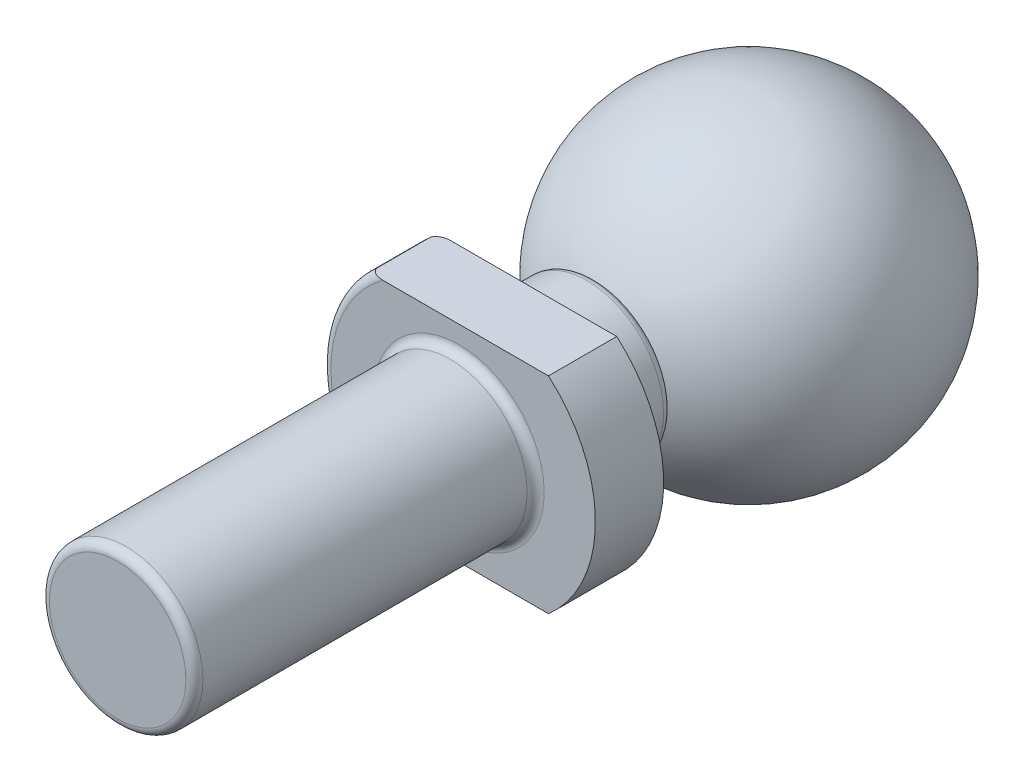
ISO-10303-21;
HEADER;
FILE_DESCRIPTION(('STEP AP214'),'2;1');
FILE_NAME('part.step','',(''),(''),'','','');
FILE_SCHEMA(('AUTOMOTIVE_DESIGN { 1 0 10303 214 1 1 1 1 }'));
ENDSEC;
DATA;
#1=APPLICATION_CONTEXT('core data for automotive mechanical design processes');
#2=APPLICATION_PROTOCOL_DEFINITION('international standard','automotive_design',2000,#1);
#3=PRODUCT_CONTEXT('',#1,'mechanical');
#4=PRODUCT('Part','Part','',(#3));
#5=PRODUCT_RELATED_PRODUCT_CATEGORY('part','',(#4));
#6=PRODUCT_DEFINITION_FORMATION('','',#4);
#7=PRODUCT_DEFINITION_CONTEXT('part definition',#1,'design');
#8=PRODUCT_DEFINITION('design','',#6,#7);
#9=PRODUCT_DEFINITION_SHAPE('','',#8);
#10=(LENGTH_UNIT() NAMED_UNIT(*) SI_UNIT(.MILLI.,.METRE.));
#11=(NAMED_UNIT(*) PLANE_ANGLE_UNIT() SI_UNIT($,.RADIAN.));
#12=(NAMED_UNIT(*) SI_UNIT($,.STERADIAN.) SOLID_ANGLE_UNIT());
#13=UNCERTAINTY_MEASURE_WITH_UNIT(LENGTH_MEASURE(1.E-05),#10,'distance_accuracy_value','');
#14=(GEOMETRIC_REPRESENTATION_CONTEXT(3) GLOBAL_UNCERTAINTY_ASSIGNED_CONTEXT((#13)) GLOBAL_UNIT_ASSIGNED_CONTEXT((#10,
#11,#12)) REPRESENTATION_CONTEXT('',''));
#15=CARTESIAN_POINT('',(0.,0.,0.));
#16=DIRECTION('',(0.,0.,1.));
#17=DIRECTION('',(1.,0.,0.));
#18=AXIS2_PLACEMENT_3D('',#15,#16,#17);
#19=CARTESIAN_POINT('',(0.,4.75,8.5));
#20=DIRECTION('',(0.,0.,-1.));
#21=DIRECTION('',(-1.,0.,0.));
#22=AXIS2_PLACEMENT_3D('',#19,#20,#21);
#23=CYLINDRICAL_SURFACE('',#22,4.);
#24=CARTESIAN_POINT('',(0.,4.75,8.5));
#25=DIRECTION('',(0.,0.,1.));
#26=DIRECTION('',(1.,0.,0.));
#27=AXIS2_PLACEMENT_3D('',#24,#25,#26);
#28=CIRCLE('',#27,4.);
#29=CARTESIAN_POINT('',(2.625,1.73182588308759,8.5));
#30=VERTEX_POINT('',#29);
#31=CARTESIAN_POINT('',(2.625,7.76817411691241,8.5));
#32=VERTEX_POINT('',#31);
#33=EDGE_CURVE('E99',#30,#32,#28,.T.);
#34=ORIENTED_EDGE('',*,*,#33,.F.);
#35=DIRECTION('',(0.,0.,1.));
#36=VECTOR('',#35,1.);
#37=CARTESIAN_POINT('',(2.625,1.73182588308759,-4.751));
#38=LINE('',#37,#36);
#39=CARTESIAN_POINT('',(2.625,1.73182588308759,6.5));
#40=VERTEX_POINT('',#39);
#41=EDGE_CURVE('E85',#40,#30,#38,.T.);
#42=ORIENTED_EDGE('',*,*,#41,.F.);
#43=CARTESIAN_POINT('',(0.,4.75,6.5));
#44=DIRECTION('',(0.,0.,1.));
#45=DIRECTION('',(1.,0.,0.));
#46=AXIS2_PLACEMENT_3D('',#43,#44,#45);
#47=CIRCLE('',#46,4.);
#48=CARTESIAN_POINT('',(2.625,7.76817411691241,6.5));
#49=VERTEX_POINT('',#48);
#50=EDGE_CURVE('E96',#40,#49,#47,.T.);
#51=ORIENTED_EDGE('',*,*,#50,.T.);
#52=DIRECTION('',(0.,0.,1.));
#53=VECTOR('',#52,1.);
#54=CARTESIAN_POINT('',(2.625,7.76817411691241,-4.751));
#55=LINE('',#54,#53);
#56=EDGE_CURVE('E107',#49,#32,#55,.T.);
#57=ORIENTED_EDGE('',*,*,#56,.T.);
#58=EDGE_LOOP('',(#34,#42,#51,#57));
#59=FACE_BOUND('',#58,.T.);
#60=ADVANCED_FACE('F26',(#59),#23,.T.);
#61=CARTESIAN_POINT('',(0.,4.75,8.5));
#62=DIRECTION('',(0.,0.,1.));
#63=DIRECTION('',(1.,0.,0.));
#64=AXIS2_PLACEMENT_3D('',#61,#62,#63);
#65=PLANE('',#64);
#66=CARTESIAN_POINT('',(0.,4.75,8.5));
#67=DIRECTION('',(0.,0.,1.));
#68=DIRECTION('',(1.,0.,0.));
#69=AXIS2_PLACEMENT_3D('',#66,#67,#68);
#70=CIRCLE('',#69,2.5);
#71=CARTESIAN_POINT('',(2.5,4.75,8.5));
#72=VERTEX_POINT('',#71);
#73=EDGE_CURVE('E131',#72,#72,#70,.F.);
#74=ORIENTED_EDGE('',*,*,#73,.T.);
#75=EDGE_LOOP('',(#74));
#76=FACE_BOUND('',#75,.T.);
#77=DIRECTION('',(1.,0.,0.));
#78=VECTOR('',#77,1.);
#79=CARTESIAN_POINT('',(-2.625,7.76817411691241,8.5));
#80=LINE('',#79,#78);
#81=CARTESIAN_POINT('',(-2.22556172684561,7.76817411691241,8.5));
#82=VERTEX_POINT('',#81);
#83=EDGE_CURVE('E90',#82,#32,#80,.T.);
#84=ORIENTED_EDGE('',*,*,#83,.F.);
#85=CARTESIAN_POINT('',(0.,4.75,8.5));
#86=DIRECTION('',(0.,0.,1.));
#87=DIRECTION('',(1.,0.,0.));
#88=AXIS2_PLACEMENT_3D('',#85,#86,#87);
#89=CIRCLE('',#88,3.75);
#90=CARTESIAN_POINT('',(-2.2255617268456,1.73182588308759,8.5));
#91=VERTEX_POINT('',#90);
#92=EDGE_CURVE('E128',#82,#91,#89,.T.);
#93=ORIENTED_EDGE('',*,*,#92,.T.);
#94=DIRECTION('',(-1.,0.,0.));
#95=VECTOR('',#94,1.);
#96=CARTESIAN_POINT('',(2.625,1.73182588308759,8.5));
#97=LINE('',#96,#95);
#98=EDGE_CURVE('E100',#30,#91,#97,.T.);
#99=ORIENTED_EDGE('',*,*,#98,.F.);
#100=ORIENTED_EDGE('',*,*,#33,.T.);
#101=EDGE_LOOP('',(#84,#93,#99,#100));
#102=FACE_BOUND('',#101,.T.);
#103=ADVANCED_FACE('F196',(#76,#102),#65,.T.);
#104=CARTESIAN_POINT('',(0.,4.75,3.));
#105=DIRECTION('',(0.,0.,1.));
#106=DIRECTION('',(1.,0.,0.));
#107=AXIS2_PLACEMENT_3D('',#104,#105,#106);
#108=PLANE('',#107);
#109=CARTESIAN_POINT('',(0.,4.75,3.));
#110=DIRECTION('',(0.,0.,1.));
#111=DIRECTION('',(1.,0.,0.));
#112=AXIS2_PLACEMENT_3D('',#109,#110,#111);
#113=CIRCLE('',#112,1.75);
#114=CARTESIAN_POINT('',(-1.75,4.75,3.));
#115=VERTEX_POINT('',#114);
#116=EDGE_CURVE('E116',#115,#115,#113,.T.);
#117=ORIENTED_EDGE('',*,*,#116,.T.);
#118=EDGE_LOOP('',(#117));
#119=FACE_BOUND('',#118,.T.);
#120=CARTESIAN_POINT('',(0.,4.75,3.));
#121=DIRECTION('',(0.,0.,1.));
#122=DIRECTION('',(1.,0.,0.));
#123=AXIS2_PLACEMENT_3D('',#120,#121,#122);
#124=CIRCLE('',#123,1.5);
#125=CARTESIAN_POINT('',(1.5,4.75,3.));
#126=VERTEX_POINT('',#125);
#127=EDGE_CURVE('E105',#126,#126,#124,.T.);
#128=ORIENTED_EDGE('',*,*,#127,.F.);
#129=EDGE_LOOP('',(#128));
#130=FACE_BOUND('',#129,.T.);
#131=ADVANCED_FACE('F203',(#119,#130),#108,.T.);
#132=CARTESIAN_POINT('',(0.,4.75,0.));
#133=DIRECTION('',(0.,-1.,0.));
#134=DIRECTION('',(-1.,0.,0.));
#135=AXIS2_PLACEMENT_3D('',#132,#133,#134);
#136=SPHERICAL_SURFACE('',#135,4.75);
#137=CARTESIAN_POINT('',(0.,4.75,0.));
#138=DIRECTION('',(0.,0.,-1.));
#139=DIRECTION('',(-1.,0.,0.));
#140=AXIS2_PLACEMENT_3D('',#137,#138,#139);
#141=SPHERICAL_SURFACE('',#140,4.75);
#142=CARTESIAN_POINT('',(0.,4.75,4.41588043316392));
#143=DIRECTION('',(0.,0.,-1.));
#144=DIRECTION('',(-1.,0.,0.));
#145=AXIS2_PLACEMENT_3D('',#142,#143,#144);
#146=CIRCLE('',#145,1.75);
#147=CARTESIAN_POINT('',(-1.75,4.75,4.41588043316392));
#148=VERTEX_POINT('',#147);
#149=EDGE_CURVE('E119',#148,#148,#146,.T.);
#150=ORIENTED_EDGE('',*,*,#149,.T.);
#151=EDGE_LOOP('',(#150));
#152=FACE_BOUND('',#151,.T.);
#153=ADVANCED_FACE('F28',(#152),#141,.T.);
#154=CARTESIAN_POINT('',(0.,4.75,4.75));
#155=DIRECTION('',(0.,0.,-1.));
#156=DIRECTION('',(-1.,0.,0.));
#157=AXIS2_PLACEMENT_3D('',#154,#155,#156);
#158=CYLINDRICAL_SURFACE('',#157,1.75);
#159=CARTESIAN_POINT('',(-1.75,4.75,4.41588043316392));
#160=CARTESIAN_POINT('',(-1.75,4.75,4.4011316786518));
#161=CARTESIAN_POINT('',(-1.75,4.75,4.38638292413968));
#162=CARTESIAN_POINT('',(-1.75,4.75,4.35688541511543));
#163=CARTESIAN_POINT('',(-1.75,4.75,4.3421366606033));
#164=CARTESIAN_POINT('',(-1.75,4.75,4.31263915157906));
#165=CARTESIAN_POINT('',(-1.75,4.75,4.29789039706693));
#166=CARTESIAN_POINT('',(-1.75,4.75,4.26839288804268));
#167=CARTESIAN_POINT('',(-1.75,4.75,4.25364413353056));
#168=CARTESIAN_POINT('',(-1.75,4.75,4.22414662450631));
#169=CARTESIAN_POINT('',(-1.75,4.75,4.20939786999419));
#170=CARTESIAN_POINT('',(-1.75,4.75,4.17990036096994));
#171=CARTESIAN_POINT('',(-1.75,4.75,4.16515160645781));
#172=CARTESIAN_POINT('',(-1.75,4.75,4.13565409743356));
#173=CARTESIAN_POINT('',(-1.75,4.75,4.12090534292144));
#174=CARTESIAN_POINT('',(-1.75,4.75,4.09140783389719));
#175=CARTESIAN_POINT('',(-1.75,4.75,4.07665907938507));
#176=CARTESIAN_POINT('',(-1.75,4.75,4.04716157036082));
#177=CARTESIAN_POINT('',(-1.75,4.75,4.0324128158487));
#178=CARTESIAN_POINT('',(-1.75,4.75,4.00291530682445));
#179=CARTESIAN_POINT('',(-1.75,4.75,3.98816655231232));
#180=CARTESIAN_POINT('',(-1.75,4.75,3.95866904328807));
#181=CARTESIAN_POINT('',(-1.75,4.75,3.94392028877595));
#182=CARTESIAN_POINT('',(-1.75,4.75,3.9144227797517));
#183=CARTESIAN_POINT('',(-1.75,4.75,3.89967402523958));
#184=CARTESIAN_POINT('',(-1.75,4.75,3.87017651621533));
#185=CARTESIAN_POINT('',(-1.75,4.75,3.8554277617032));
#186=CARTESIAN_POINT('',(-1.75,4.75,3.82593025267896));
#187=CARTESIAN_POINT('',(-1.75,4.75,3.81118149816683));
#188=CARTESIAN_POINT('',(-1.75,4.75,3.78168398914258));
#189=CARTESIAN_POINT('',(-1.75,4.75,3.76693523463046));
#190=CARTESIAN_POINT('',(-1.75,4.75,3.73743772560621));
#191=CARTESIAN_POINT('',(-1.75,4.75,3.72268897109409));
#192=CARTESIAN_POINT('',(-1.75,4.75,3.69319146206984));
#193=CARTESIAN_POINT('',(-1.75,4.75,3.67844270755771));
#194=CARTESIAN_POINT('',(-1.75,4.75,3.64894519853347));
#195=CARTESIAN_POINT('',(-1.75,4.75,3.63419644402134));
#196=CARTESIAN_POINT('',(-1.75,4.75,3.60469893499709));
#197=CARTESIAN_POINT('',(-1.75,4.75,3.58995018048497));
#198=CARTESIAN_POINT('',(-1.75,4.75,3.56045267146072));
#199=CARTESIAN_POINT('',(-1.75,4.75,3.5457039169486));
#200=CARTESIAN_POINT('',(-1.75,4.75,3.51620640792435));
#201=CARTESIAN_POINT('',(-1.75,4.75,3.50145765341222));
#202=CARTESIAN_POINT('',(-1.75,4.75,3.47196014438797));
#203=CARTESIAN_POINT('',(-1.75,4.75,3.45721138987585));
#204=CARTESIAN_POINT('',(-1.75,4.75,3.4277138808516));
#205=CARTESIAN_POINT('',(-1.75,4.75,3.41296512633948));
#206=CARTESIAN_POINT('',(-1.75,4.75,3.38346761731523));
#207=CARTESIAN_POINT('',(-1.75,4.75,3.36871886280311));
#208=CARTESIAN_POINT('',(-1.75,4.75,3.33922135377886));
#209=CARTESIAN_POINT('',(-1.75,4.75,3.32447259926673));
#210=CARTESIAN_POINT('',(-1.75,4.75,3.29497509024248));
#211=CARTESIAN_POINT('',(-1.75,4.75,3.28022633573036));
#212=CARTESIAN_POINT('',(-1.75,4.75,3.25072882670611));
#213=CARTESIAN_POINT('',(-1.75,4.75,3.23598007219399));
#214=CARTESIAN_POINT('',(-1.75,4.75,3.20648256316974));
#215=CARTESIAN_POINT('',(-1.75,4.75,3.19173380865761));
#216=CARTESIAN_POINT('',(-1.75,4.75,3.16223629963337));
#217=CARTESIAN_POINT('',(-1.75,4.75,3.14748754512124));
#218=CARTESIAN_POINT('',(-1.75,4.75,3.11799003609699));
#219=CARTESIAN_POINT('',(-1.75,4.75,3.10324128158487));
#220=CARTESIAN_POINT('',(-1.75,4.75,3.07374377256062));
#221=CARTESIAN_POINT('',(-1.75,4.75,3.0589950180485));
#222=CARTESIAN_POINT('',(-1.75,4.75,3.02949750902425));
#223=CARTESIAN_POINT('',(-1.75,4.75,3.01474875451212));
#224=CARTESIAN_POINT('',(-1.75,4.75,3.));
#225=B_SPLINE_CURVE_WITH_KNOTS('',3,(#159,#160,#161,#162,#163,#164,#165,#166,#167,#168,#169,
#170,#171,#172,#173,#174,#175,#176,#177,#178,#179,#180,#181,#182,#183,#184,#185,#186,#187,#188,
#189,#190,#191,#192,#193,#194,#195,#196,#197,#198,#199,#200,#201,#202,#203,#204,#205,#206,#207,
#208,#209,#210,#211,#212,#213,#214,#215,#216,#217,#218,#219,#220,#221,#222,#223,#224),
.UNSPECIFIED.,.F.,.F.,(4,2,2,2,2,2,2,2,2,2,2,2,2,2,2,2,2,2,2,2,2,2,2,2,2,2,2,2,2,2,2,2,4),(0.,
0.0442462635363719,0.0884925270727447,0.132738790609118,0.17698505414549,0.221231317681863,
0.265477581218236,0.309723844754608,0.353970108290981,0.398216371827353,0.442462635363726,
0.486708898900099,0.530955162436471,0.575201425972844,0.619447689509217,0.663693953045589,
0.707940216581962,0.752186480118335,0.796432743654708,0.84067900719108,0.884925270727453,
0.929171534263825,0.973417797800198,1.01766406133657,1.06191032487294,1.10615658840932,
1.15040285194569,1.19464911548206,1.23889537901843,1.28314164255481,1.32738790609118,
1.37163416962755,1.41588043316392),.UNSPECIFIED.);
#226=EDGE_CURVE('BSEAM313',#148,#115,#225,.T.);
#227=ORIENTED_EDGE('',*,*,#149,.F.);
#228=ORIENTED_EDGE('',*,*,#116,.F.);
#229=ORIENTED_EDGE('',*,*,#226,.T.);
#230=ORIENTED_EDGE('',*,*,#226,.F.);
#231=EDGE_LOOP('',(#227,#229,#228,#230));
#232=FACE_BOUND('',#231,.T.);
#233=ADVANCED_FACE('F313',(#232),#158,.F.);
#234=CARTESIAN_POINT('',(0.,4.75,4.5));
#235=DIRECTION('',(0.,0.,-1.));
#236=DIRECTION('',(-1.,0.,0.));
#237=AXIS2_PLACEMENT_3D('',#234,#235,#236);
#238=CYLINDRICAL_SURFACE('',#237,1.5);
#239=CARTESIAN_POINT('',(0.,4.75,4.5));
#240=DIRECTION('',(0.,0.,1.));
#241=DIRECTION('',(1.,0.,0.));
#242=AXIS2_PLACEMENT_3D('',#239,#240,#241);
#243=CIRCLE('',#242,1.5);
#244=CARTESIAN_POINT('',(1.5,4.75,4.5));
#245=VERTEX_POINT('',#244);
#246=EDGE_CURVE('E113',#245,#245,#243,.T.);
#247=ORIENTED_EDGE('',*,*,#246,.F.);
#248=EDGE_LOOP('',(#247));
#249=FACE_BOUND('',#248,.T.);
#250=ORIENTED_EDGE('',*,*,#127,.T.);
#251=EDGE_LOOP('',(#250));
#252=FACE_BOUND('',#251,.T.);
#253=ADVANCED_FACE('F307',(#249,#252),#238,.T.);
#254=CARTESIAN_POINT('',(0.,4.75,4.5));
#255=DIRECTION('',(0.,0.,1.));
#256=DIRECTION('',(1.,0.,0.));
#257=AXIS2_PLACEMENT_3D('',#254,#255,#256);
#258=PLANE('',#257);
#259=CARTESIAN_POINT('',(0.,4.75,4.5));
#260=DIRECTION('',(0.,0.,1.));
#261=DIRECTION('',(1.,0.,0.));
#262=AXIS2_PLACEMENT_3D('',#259,#260,#261);
#263=CIRCLE('',#262,2.);
#264=CARTESIAN_POINT('',(2.,4.75,4.5));
#265=VERTEX_POINT('',#264);
#266=EDGE_CURVE('E11',#265,#265,#263,.F.);
#267=ORIENTED_EDGE('',*,*,#266,.T.);
#268=EDGE_LOOP('',(#267));
#269=FACE_BOUND('',#268,.T.);
#270=ORIENTED_EDGE('',*,*,#246,.T.);
#271=EDGE_LOOP('',(#270));
#272=FACE_BOUND('',#271,.T.);
#273=ADVANCED_FACE('F301',(#269,#272),#258,.F.);
#274=CARTESIAN_POINT('',(0.,4.75,6.5));
#275=DIRECTION('',(0.,0.,-1.));
#276=DIRECTION('',(-1.,0.,0.));
#277=AXIS2_PLACEMENT_3D('',#274,#275,#276);
#278=CYLINDRICAL_SURFACE('',#277,2.25);
#279=CARTESIAN_POINT('',(0.,4.75,6.25));
#280=DIRECTION('',(0.,0.,1.));
#281=DIRECTION('',(1.,0.,0.));
#282=AXIS2_PLACEMENT_3D('',#279,#280,#281);
#283=CIRCLE('',#282,2.25);
#284=CARTESIAN_POINT('',(2.25,4.75,6.25));
#285=VERTEX_POINT('',#284);
#286=EDGE_CURVE('E34',#285,#285,#283,.F.);
#287=ORIENTED_EDGE('',*,*,#286,.T.);
#288=EDGE_LOOP('',(#287));
#289=FACE_BOUND('',#288,.T.);
#290=CARTESIAN_POINT('',(0.,4.75,4.75));
#291=DIRECTION('',(0.,0.,1.));
#292=DIRECTION('',(1.,0.,0.));
#293=AXIS2_PLACEMENT_3D('',#290,#291,#292);
#294=CIRCLE('',#293,2.25);
#295=CARTESIAN_POINT('',(2.25,4.75,4.75));
#296=VERTEX_POINT('',#295);
#297=EDGE_CURVE('E231',#296,#296,#294,.T.);
#298=ORIENTED_EDGE('',*,*,#297,.T.);
#299=EDGE_LOOP('',(#298));
#300=FACE_BOUND('',#299,.T.);
#301=ADVANCED_FACE('F214',(#289,#300),#278,.T.);
#302=CARTESIAN_POINT('',(0.,4.75,6.5));
#303=DIRECTION('',(0.,0.,1.));
#304=DIRECTION('',(1.,0.,0.));
#305=AXIS2_PLACEMENT_3D('',#302,#303,#304);
#306=PLANE('',#305);
#307=CARTESIAN_POINT('',(0.,4.75,6.5));
#308=DIRECTION('',(0.,0.,1.));
#309=DIRECTION('',(1.,0.,0.));
#310=AXIS2_PLACEMENT_3D('',#307,#308,#309);
#311=CIRCLE('',#310,2.5);
#312=CARTESIAN_POINT('',(2.5,4.75,6.5));
#313=VERTEX_POINT('',#312);
#314=EDGE_CURVE('E179',#313,#313,#311,.T.);
#315=ORIENTED_EDGE('',*,*,#314,.T.);
#316=EDGE_LOOP('',(#315));
#317=FACE_BOUND('',#316,.T.);
#318=DIRECTION('',(1.,0.,0.));
#319=VECTOR('',#318,1.);
#320=CARTESIAN_POINT('',(2.625,1.73182588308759,6.5));
#321=LINE('',#320,#319);
#322=CARTESIAN_POINT('',(-2.22556172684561,1.73182588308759,6.5));
#323=VERTEX_POINT('',#322);
#324=EDGE_CURVE('E81',#323,#40,#321,.T.);
#325=ORIENTED_EDGE('',*,*,#324,.F.);
#326=CARTESIAN_POINT('',(0.,4.75,6.5));
#327=DIRECTION('',(0.,0.,1.));
#328=DIRECTION('',(1.,0.,0.));
#329=AXIS2_PLACEMENT_3D('',#326,#327,#328);
#330=CIRCLE('',#329,3.75);
#331=CARTESIAN_POINT('',(-2.22556172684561,7.76817411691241,6.5));
#332=VERTEX_POINT('',#331);
#333=EDGE_CURVE('E41',#323,#332,#330,.F.);
#334=ORIENTED_EDGE('',*,*,#333,.T.);
#335=DIRECTION('',(-1.,0.,0.));
#336=VECTOR('',#335,1.);
#337=CARTESIAN_POINT('',(-2.625,7.76817411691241,6.5));
#338=LINE('',#337,#336);
#339=EDGE_CURVE('E103',#49,#332,#338,.T.);
#340=ORIENTED_EDGE('',*,*,#339,.F.);
#341=ORIENTED_EDGE('',*,*,#50,.F.);
#342=EDGE_LOOP('',(#325,#334,#340,#341));
#343=FACE_BOUND('',#342,.T.);
#344=ADVANCED_FACE('F102',(#317,#343),#306,.F.);
#345=DIRECTION('',(0.,0.,1.));
#346=VECTOR('',#345,1.);
#347=CARTESIAN_POINT('',(-2.625,1.73182588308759,-4.751));
#348=LINE('',#347,#346);
#349=CARTESIAN_POINT('',(-2.625,1.73182588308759,6.75));
#350=VERTEX_POINT('',#349);
#351=CARTESIAN_POINT('',(-2.625,1.73182588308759,8.25));
#352=VERTEX_POINT('',#351);
#353=EDGE_CURVE('E91',#350,#352,#348,.T.);
#354=ORIENTED_EDGE('',*,*,#353,.T.);
#355=CARTESIAN_POINT('',(0.,4.75,8.25));
#356=DIRECTION('',(0.,0.,1.));
#357=DIRECTION('',(1.,0.,0.));
#358=AXIS2_PLACEMENT_3D('',#355,#356,#357);
#359=CIRCLE('',#358,4.);
#360=CARTESIAN_POINT('',(-2.625,7.76817411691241,8.25));
#361=VERTEX_POINT('',#360);
#362=EDGE_CURVE('E49',#352,#361,#359,.F.);
#363=ORIENTED_EDGE('',*,*,#362,.T.);
#364=DIRECTION('',(0.,0.,1.));
#365=VECTOR('',#364,1.);
#366=CARTESIAN_POINT('',(-2.625,7.76817411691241,-4.751));
#367=LINE('',#366,#365);
#368=CARTESIAN_POINT('',(-2.625,7.76817411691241,6.75));
#369=VERTEX_POINT('',#368);
#370=EDGE_CURVE('E227',#369,#361,#367,.T.);
#371=ORIENTED_EDGE('',*,*,#370,.F.);
#372=CARTESIAN_POINT('',(0.,4.75,6.75));
#373=DIRECTION('',(0.,0.,1.));
#374=DIRECTION('',(1.,0.,0.));
#375=AXIS2_PLACEMENT_3D('',#372,#373,#374);
#376=CIRCLE('',#375,4.);
#377=EDGE_CURVE('E219',#369,#350,#376,.T.);
#378=ORIENTED_EDGE('',*,*,#377,.T.);
#379=EDGE_LOOP('',(#354,#363,#371,#378));
#380=FACE_BOUND('',#379,.T.);
#381=ADVANCED_FACE('F198',(#380),#23,.T.);
#382=CARTESIAN_POINT('',(0.,4.75,18.5));
#383=DIRECTION('',(0.,0.,-1.));
#384=DIRECTION('',(-1.,0.,0.));
#385=AXIS2_PLACEMENT_3D('',#382,#383,#384);
#386=CYLINDRICAL_SURFACE('',#385,2.25);
#387=CARTESIAN_POINT('',(0.,4.75,8.75));
#388=DIRECTION('',(0.,0.,1.));
#389=DIRECTION('',(1.,0.,0.));
#390=AXIS2_PLACEMENT_3D('',#387,#388,#389);
#391=CIRCLE('',#390,2.25);
#392=CARTESIAN_POINT('',(2.25,4.75,8.75));
#393=VERTEX_POINT('',#392);
#394=EDGE_CURVE('E125',#393,#393,#391,.T.);
#395=ORIENTED_EDGE('',*,*,#394,.T.);
#396=EDGE_LOOP('',(#395));
#397=FACE_BOUND('',#396,.T.);
#398=CARTESIAN_POINT('',(0.,4.75,18.25));
#399=DIRECTION('',(0.,0.,1.));
#400=DIRECTION('',(1.,0.,0.));
#401=AXIS2_PLACEMENT_3D('',#398,#399,#400);
#402=CIRCLE('',#401,2.25);
#403=CARTESIAN_POINT('',(2.25,4.75,18.25));
#404=VERTEX_POINT('',#403);
#405=EDGE_CURVE('E122',#404,#404,#402,.F.);
#406=ORIENTED_EDGE('',*,*,#405,.T.);
#407=EDGE_LOOP('',(#406));
#408=FACE_BOUND('',#407,.T.);
#409=ADVANCED_FACE('F208',(#397,#408),#386,.T.);
#410=CARTESIAN_POINT('',(0.,4.75,18.5));
#411=DIRECTION('',(0.,0.,1.));
#412=DIRECTION('',(1.,0.,0.));
#413=AXIS2_PLACEMENT_3D('',#410,#411,#412);
#414=PLANE('',#413);
#415=CARTESIAN_POINT('',(0.,4.75,18.5));
#416=DIRECTION('',(0.,0.,1.));
#417=DIRECTION('',(1.,0.,0.));
#418=AXIS2_PLACEMENT_3D('',#415,#416,#417);
#419=CIRCLE('',#418,2.);
#420=CARTESIAN_POINT('',(2.,4.75,18.5));
#421=VERTEX_POINT('',#420);
#422=EDGE_CURVE('E134',#421,#421,#419,.T.);
#423=ORIENTED_EDGE('',*,*,#422,.T.);
#424=EDGE_LOOP('',(#423));
#425=FACE_BOUND('',#424,.T.);
#426=ADVANCED_FACE('F163',(#425),#414,.T.);
#427=CARTESIAN_POINT('',(-2.625,7.76817411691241,-4.751));
#428=DIRECTION('',(0.,-1.,0.));
#429=DIRECTION('',(0.,0.,-1.));
#430=AXIS2_PLACEMENT_3D('',#427,#428,#429);
#431=PLANE('',#430);
#432=ORIENTED_EDGE('',*,*,#370,.T.);
#433=CARTESIAN_POINT('',(-2.625,7.76817411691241,8.25));
#434=CARTESIAN_POINT('',(-2.62502814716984,7.76817411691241,8.26069855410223));
#435=CARTESIAN_POINT('',(-2.6239555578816,7.76817411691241,8.27136550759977));
#436=CARTESIAN_POINT('',(-2.6198574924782,7.76817411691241,8.29221444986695));
#437=CARTESIAN_POINT('',(-2.6168511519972,7.76817411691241,8.3024001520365));
#438=CARTESIAN_POINT('',(-2.60913836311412,7.76817411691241,8.3220534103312));
#439=CARTESIAN_POINT('',(-2.60443752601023,7.76817411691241,8.33152321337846));
#440=CARTESIAN_POINT('',(-2.59364026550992,7.76817411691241,8.34964834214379));
#441=CARTESIAN_POINT('',(-2.58754028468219,7.76817411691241,8.35830151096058));
#442=CARTESIAN_POINT('',(-2.5712141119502,7.76817411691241,8.3784465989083));
#443=CARTESIAN_POINT('',(-2.5603731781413,7.76817411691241,8.38943930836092));
#444=CARTESIAN_POINT('',(-2.53709998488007,7.76817411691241,8.40956808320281));
#445=CARTESIAN_POINT('',(-2.52466493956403,7.76817411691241,8.41870082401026));
#446=CARTESIAN_POINT('',(-2.49211901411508,7.76817411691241,8.43947285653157));
#447=CARTESIAN_POINT('',(-2.4713188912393,7.76817411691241,8.4500272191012));
#448=CARTESIAN_POINT('',(-2.42831662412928,7.76817411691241,8.46783841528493));
#449=CARTESIAN_POINT('',(-2.4061092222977,7.76817411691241,8.47508193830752));
#450=CARTESIAN_POINT('',(-2.35762990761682,7.76817411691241,8.48756106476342));
#451=CARTESIAN_POINT('',(-2.33124330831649,7.76817411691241,8.49234012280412));
#452=CARTESIAN_POINT('',(-2.27839856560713,7.76817411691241,8.49852310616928));
#453=CARTESIAN_POINT('',(-2.25194533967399,7.76817411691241,8.49996802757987));
#454=CARTESIAN_POINT('',(-2.22556172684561,7.76817411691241,8.5));
#455=B_SPLINE_CURVE_WITH_KNOTS('',3,(#433,#434,#435,#436,#437,#438,#439,#440,#441,#442,#443,
#444,#445,#446,#447,#448,#449,#450,#451,#452,#453,#454),.UNSPECIFIED.,.F.,.F.,(4,2,2,2,2,2,2,2,
2,2,4),(0.,0.0319919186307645,0.0636720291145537,0.0952481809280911,0.126905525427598,
0.172963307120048,0.2191027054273,0.288690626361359,0.358555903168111,0.438773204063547,
0.51799878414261),.UNSPECIFIED.);
#456=EDGE_CURVE('E174',#361,#82,#455,.T.);
#457=ORIENTED_EDGE('',*,*,#456,.T.);
#458=ORIENTED_EDGE('',*,*,#83,.T.);
#459=ORIENTED_EDGE('',*,*,#56,.F.);
#460=ORIENTED_EDGE('',*,*,#339,.T.);
#461=CARTESIAN_POINT('',(-2.22556172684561,7.76817411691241,6.5));
#462=CARTESIAN_POINT('',(-2.24380223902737,7.76817411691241,6.50000707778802));
#463=CARTESIAN_POINT('',(-2.26205346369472,7.76817411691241,6.50070393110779));
#464=CARTESIAN_POINT('',(-2.29850995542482,7.76817411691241,6.50360005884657));
#465=CARTESIAN_POINT('',(-2.31671472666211,7.76817411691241,6.5058054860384));
#466=CARTESIAN_POINT('',(-2.35311269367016,7.76817411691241,6.51188592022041));
#467=CARTESIAN_POINT('',(-2.3713021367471,7.76817411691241,6.51578393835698));
#468=CARTESIAN_POINT('',(-2.40715784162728,7.76817411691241,6.52542702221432));
#469=CARTESIAN_POINT('',(-2.42482504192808,7.76817411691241,6.5311685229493));
#470=CARTESIAN_POINT('',(-2.45801582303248,7.76817411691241,6.54420565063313));
#471=CARTESIAN_POINT('',(-2.47359944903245,7.76817411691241,6.55134646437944));
#472=CARTESIAN_POINT('',(-2.50366690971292,7.76817411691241,6.56759997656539));
#473=CARTESIAN_POINT('',(-2.51815402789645,7.76817411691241,6.57670644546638));
#474=CARTESIAN_POINT('',(-2.54314148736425,7.76817411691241,6.59536469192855));
#475=CARTESIAN_POINT('',(-2.55389863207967,7.76817411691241,6.60456927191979));
#476=CARTESIAN_POINT('',(-2.57381821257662,7.76817411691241,6.62458567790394));
#477=CARTESIAN_POINT('',(-2.58298253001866,7.76817411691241,6.63539557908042));
#478=CARTESIAN_POINT('',(-2.59702515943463,7.76817411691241,6.65562110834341));
#479=CARTESIAN_POINT('',(-2.60240058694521,7.76817411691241,6.66469036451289));
#480=CARTESIAN_POINT('',(-2.6115983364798,7.76817411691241,6.68357479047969));
#481=CARTESIAN_POINT('',(-2.61542442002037,7.76817411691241,6.69338808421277));
#482=CARTESIAN_POINT('',(-2.6205157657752,7.76817411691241,6.7110008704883));
#483=CARTESIAN_POINT('',(-2.62218333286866,7.76817411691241,6.71868489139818));
#484=CARTESIAN_POINT('',(-2.624432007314,7.76817411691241,6.73424228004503));
#485=CARTESIAN_POINT('',(-2.62500850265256,7.76817411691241,6.74211630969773));
#486=CARTESIAN_POINT('',(-2.625,7.76817411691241,6.75));
#487=B_SPLINE_CURVE_WITH_KNOTS('',3,(#461,#462,#463,#464,#465,#466,#467,#468,#469,#470,#471,
#472,#473,#474,#475,#476,#477,#478,#479,#480,#481,#482,#483,#484,#485,#486),.UNSPECIFIED.,.F.,
.F.,(4,2,2,2,2,2,2,2,2,2,2,2,4),(0.,0.0547248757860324,0.109674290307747,0.165395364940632,
0.221009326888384,0.27231585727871,0.323462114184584,0.365794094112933,0.408075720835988,
0.439585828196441,0.471018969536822,0.494533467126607,0.518147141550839),.UNSPECIFIED.);
#488=EDGE_CURVE('E168',#332,#369,#487,.T.);
#489=ORIENTED_EDGE('',*,*,#488,.T.);
#490=EDGE_LOOP('',(#432,#457,#458,#459,#460,#489));
#491=FACE_BOUND('',#490,.T.);
#492=ADVANCED_FACE('F157',(#491),#431,.F.);
#493=CARTESIAN_POINT('',(2.625,1.73182588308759,-4.751));
#494=DIRECTION('',(0.,1.,0.));
#495=DIRECTION('',(-1.,0.,0.));
#496=AXIS2_PLACEMENT_3D('',#493,#494,#495);
#497=PLANE('',#496);
#498=ORIENTED_EDGE('',*,*,#98,.T.);
#499=CARTESIAN_POINT('',(-2.22556172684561,1.73182588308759,8.5));
#500=CARTESIAN_POINT('',(-2.24380223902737,1.73182588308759,8.49999292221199));
#501=CARTESIAN_POINT('',(-2.26205346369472,1.73182588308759,8.49929606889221));
#502=CARTESIAN_POINT('',(-2.29850995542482,1.73182588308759,8.49639994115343));
#503=CARTESIAN_POINT('',(-2.31671472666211,1.73182588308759,8.4941945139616));
#504=CARTESIAN_POINT('',(-2.35311269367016,1.73182588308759,8.48811407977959));
#505=CARTESIAN_POINT('',(-2.3713021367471,1.73182588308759,8.48421606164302));
#506=CARTESIAN_POINT('',(-2.40715784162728,1.73182588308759,8.47457297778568));
#507=CARTESIAN_POINT('',(-2.42482504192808,1.73182588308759,8.4688314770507));
#508=CARTESIAN_POINT('',(-2.45801582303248,1.73182588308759,8.45579434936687));
#509=CARTESIAN_POINT('',(-2.47359944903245,1.73182588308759,8.44865353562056));
#510=CARTESIAN_POINT('',(-2.50366690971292,1.73182588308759,8.43240002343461));
#511=CARTESIAN_POINT('',(-2.51815402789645,1.73182588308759,8.42329355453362));
#512=CARTESIAN_POINT('',(-2.54314148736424,1.73182588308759,8.40463530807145));
#513=CARTESIAN_POINT('',(-2.55389863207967,1.73182588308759,8.39543072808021));
#514=CARTESIAN_POINT('',(-2.57381821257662,1.73182588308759,8.37541432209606));
#515=CARTESIAN_POINT('',(-2.58298253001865,1.73182588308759,8.36460442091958));
#516=CARTESIAN_POINT('',(-2.59702515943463,1.73182588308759,8.34437889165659));
#517=CARTESIAN_POINT('',(-2.6024005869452,1.73182588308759,8.33530963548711));
#518=CARTESIAN_POINT('',(-2.6115983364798,1.73182588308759,8.31642520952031));
#519=CARTESIAN_POINT('',(-2.61542442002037,1.73182588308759,8.30661191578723));
#520=CARTESIAN_POINT('',(-2.62051576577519,1.73182588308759,8.2889991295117));
#521=CARTESIAN_POINT('',(-2.62218333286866,1.73182588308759,8.28131510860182));
#522=CARTESIAN_POINT('',(-2.624432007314,1.73182588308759,8.26575771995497));
#523=CARTESIAN_POINT('',(-2.62500850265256,1.73182588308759,8.25788369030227));
#524=CARTESIAN_POINT('',(-2.625,1.73182588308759,8.25));
#525=B_SPLINE_CURVE_WITH_KNOTS('',3,(#499,#500,#501,#502,#503,#504,#505,#506,#507,#508,#509,
#510,#511,#512,#513,#514,#515,#516,#517,#518,#519,#520,#521,#522,#523,#524),.UNSPECIFIED.,.F.,
.F.,(4,2,2,2,2,2,2,2,2,2,2,2,4),(0.,0.0547248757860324,0.109674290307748,0.165395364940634,
0.221009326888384,0.272315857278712,0.323462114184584,0.365794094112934,0.408075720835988,
0.439585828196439,0.471018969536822,0.494533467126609,0.51814714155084),.UNSPECIFIED.);
#526=EDGE_CURVE('E143',#91,#352,#525,.T.);
#527=ORIENTED_EDGE('',*,*,#526,.T.);
#528=ORIENTED_EDGE('',*,*,#353,.F.);
#529=CARTESIAN_POINT('',(-2.625,1.73182588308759,6.75));
#530=CARTESIAN_POINT('',(-2.62502814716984,1.73182588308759,6.73930144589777));
#531=CARTESIAN_POINT('',(-2.6239555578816,1.73182588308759,6.72863449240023));
#532=CARTESIAN_POINT('',(-2.6198574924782,1.73182588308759,6.70778555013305));
#533=CARTESIAN_POINT('',(-2.6168511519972,1.73182588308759,6.6975998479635));
#534=CARTESIAN_POINT('',(-2.60913836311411,1.73182588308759,6.6779465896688));
#535=CARTESIAN_POINT('',(-2.60443752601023,1.73182588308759,6.66847678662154));
#536=CARTESIAN_POINT('',(-2.59364026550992,1.73182588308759,6.65035165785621));
#537=CARTESIAN_POINT('',(-2.58754028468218,1.73182588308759,6.64169848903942));
#538=CARTESIAN_POINT('',(-2.5712141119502,1.73182588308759,6.6215534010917));
#539=CARTESIAN_POINT('',(-2.5603731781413,1.73182588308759,6.61056069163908));
#540=CARTESIAN_POINT('',(-2.53709998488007,1.73182588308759,6.59043191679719));
#541=CARTESIAN_POINT('',(-2.52466493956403,1.73182588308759,6.58129917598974));
#542=CARTESIAN_POINT('',(-2.49211901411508,1.73182588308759,6.56052714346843));
#543=CARTESIAN_POINT('',(-2.4713188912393,1.73182588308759,6.5499727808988));
#544=CARTESIAN_POINT('',(-2.42831662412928,1.73182588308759,6.53216158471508));
#545=CARTESIAN_POINT('',(-2.40610922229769,1.73182588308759,6.52491806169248));
#546=CARTESIAN_POINT('',(-2.35762990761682,1.73182588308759,6.51243893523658));
#547=CARTESIAN_POINT('',(-2.33124330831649,1.73182588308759,6.50765987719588));
#548=CARTESIAN_POINT('',(-2.27839856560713,1.73182588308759,6.50147689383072));
#549=CARTESIAN_POINT('',(-2.25194533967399,1.73182588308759,6.50003197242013));
#550=CARTESIAN_POINT('',(-2.22556172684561,1.73182588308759,6.5));
#551=B_SPLINE_CURVE_WITH_KNOTS('',3,(#529,#530,#531,#532,#533,#534,#535,#536,#537,#538,#539,
#540,#541,#542,#543,#544,#545,#546,#547,#548,#549,#550),.UNSPECIFIED.,.F.,.F.,(4,2,2,2,2,2,2,2,
2,2,4),(0.,0.0319919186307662,0.0636720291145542,0.0952481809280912,0.126905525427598,
0.172963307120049,0.219102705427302,0.288690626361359,0.358555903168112,0.438773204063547,
0.517998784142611),.UNSPECIFIED.);
#552=EDGE_CURVE('E88',#350,#323,#551,.T.);
#553=ORIENTED_EDGE('',*,*,#552,.T.);
#554=ORIENTED_EDGE('',*,*,#324,.T.);
#555=ORIENTED_EDGE('',*,*,#41,.T.);
#556=EDGE_LOOP('',(#498,#527,#528,#553,#554,#555));
#557=FACE_BOUND('',#556,.T.);
#558=ADVANCED_FACE('F84',(#557),#497,.F.);
#559=CARTESIAN_POINT('',(0.,4.75,8.75));
#560=DIRECTION('',(0.,0.,1.));
#561=DIRECTION('',(1.,0.,0.));
#562=AXIS2_PLACEMENT_3D('',#559,#560,#561);
#563=TOROIDAL_SURFACE('',#562,2.5,0.25);
#564=ORIENTED_EDGE('',*,*,#73,.F.);
#565=EDGE_LOOP('',(#564));
#566=FACE_BOUND('',#565,.T.);
#567=ORIENTED_EDGE('',*,*,#394,.F.);
#568=EDGE_LOOP('',(#567));
#569=FACE_BOUND('',#568,.T.);
#570=ADVANCED_FACE('F156',(#566,#569),#563,.F.);
#571=CARTESIAN_POINT('',(0.,4.75,18.25));
#572=DIRECTION('',(0.,0.,1.));
#573=DIRECTION('',(1.,0.,0.));
#574=AXIS2_PLACEMENT_3D('',#571,#572,#573);
#575=TOROIDAL_SURFACE('',#574,2.,0.25);
#576=ORIENTED_EDGE('',*,*,#405,.F.);
#577=EDGE_LOOP('',(#576));
#578=FACE_BOUND('',#577,.T.);
#579=ORIENTED_EDGE('',*,*,#422,.F.);
#580=EDGE_LOOP('',(#579));
#581=FACE_BOUND('',#580,.T.);
#582=ADVANCED_FACE('F184',(#578,#581),#575,.T.);
#583=CARTESIAN_POINT('',(0.,4.75,8.25));
#584=DIRECTION('',(0.,0.,1.));
#585=DIRECTION('',(1.,0.,0.));
#586=AXIS2_PLACEMENT_3D('',#583,#584,#585);
#587=TOROIDAL_SURFACE('',#586,3.75,0.25);
#588=ORIENTED_EDGE('',*,*,#456,.F.);
#589=ORIENTED_EDGE('',*,*,#362,.F.);
#590=ORIENTED_EDGE('',*,*,#526,.F.);
#591=ORIENTED_EDGE('',*,*,#92,.F.);
#592=EDGE_LOOP('',(#588,#589,#590,#591));
#593=FACE_BOUND('',#592,.T.);
#594=ADVANCED_FACE('F181',(#593),#587,.T.);
#595=CARTESIAN_POINT('',(0.,4.75,6.75));
#596=DIRECTION('',(0.,0.,1.));
#597=DIRECTION('',(1.,0.,0.));
#598=AXIS2_PLACEMENT_3D('',#595,#596,#597);
#599=TOROIDAL_SURFACE('',#598,3.75,0.25);
#600=ORIENTED_EDGE('',*,*,#488,.F.);
#601=ORIENTED_EDGE('',*,*,#333,.F.);
#602=ORIENTED_EDGE('',*,*,#552,.F.);
#603=ORIENTED_EDGE('',*,*,#377,.F.);
#604=EDGE_LOOP('',(#600,#601,#602,#603));
#605=FACE_BOUND('',#604,.T.);
#606=ADVANCED_FACE('F149',(#605),#599,.T.);
#607=CARTESIAN_POINT('',(0.,4.75,6.25));
#608=DIRECTION('',(0.,0.,1.));
#609=DIRECTION('',(1.,0.,0.));
#610=AXIS2_PLACEMENT_3D('',#607,#608,#609);
#611=TOROIDAL_SURFACE('',#610,2.5,0.25);
#612=ORIENTED_EDGE('',*,*,#286,.F.);
#613=EDGE_LOOP('',(#612));
#614=FACE_BOUND('',#613,.T.);
#615=ORIENTED_EDGE('',*,*,#314,.F.);
#616=EDGE_LOOP('',(#615));
#617=FACE_BOUND('',#616,.T.);
#618=ADVANCED_FACE('F240',(#614,#617),#611,.F.);
#619=CARTESIAN_POINT('',(0.,4.75,4.75));
#620=DIRECTION('',(0.,0.,1.));
#621=DIRECTION('',(1.,0.,0.));
#622=AXIS2_PLACEMENT_3D('',#619,#620,#621);
#623=TOROIDAL_SURFACE('',#622,2.,0.25);
#624=ORIENTED_EDGE('',*,*,#266,.F.);
#625=EDGE_LOOP('',(#624));
#626=FACE_BOUND('',#625,.T.);
#627=ORIENTED_EDGE('',*,*,#297,.F.);
#628=EDGE_LOOP('',(#627));
#629=FACE_BOUND('',#628,.T.);
#630=ADVANCED_FACE('F243',(#626,#629),#623,.T.);
#631=CLOSED_SHELL('',(#60,#103,#131,#153,#233,#253,#273,#301,#344,#381,#409,#426,#492,#558,#570,
#582,#594,#606,#618,#630));
#632=MANIFOLD_SOLID_BREP('B2',#631);
#633=ADVANCED_BREP_SHAPE_REPRESENTATION('',(#18,#632),#14);
#634=SHAPE_DEFINITION_REPRESENTATION(#9,#633);
ENDSEC;
END-ISO-10303-21;
